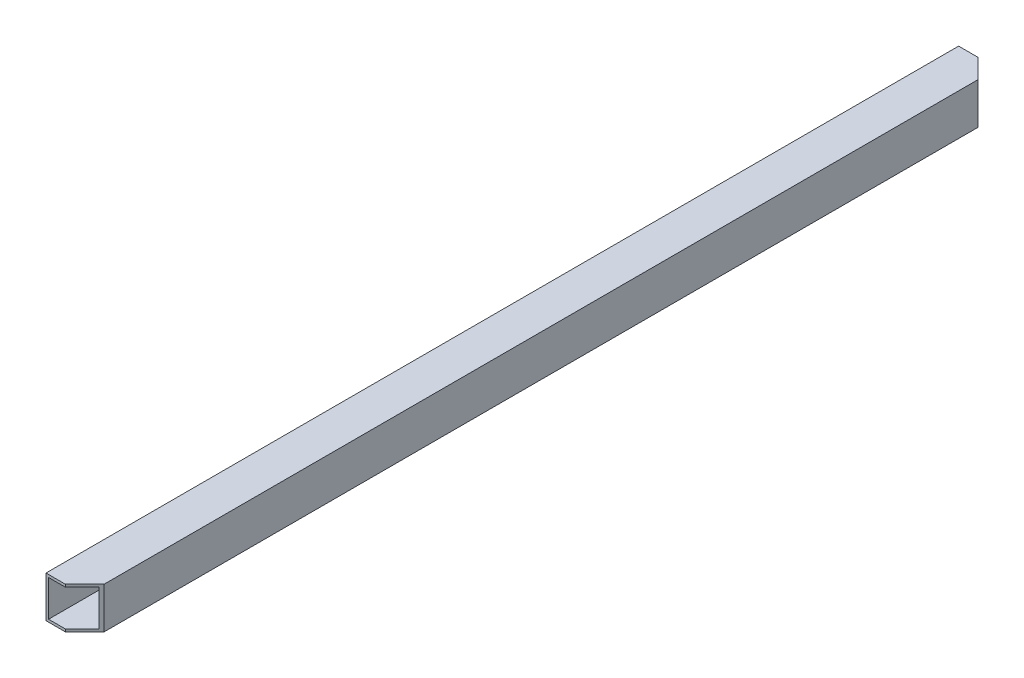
ISO-10303-21;
HEADER;
FILE_DESCRIPTION(('STEP AP214'),'2;1');
FILE_NAME('part.step','',(''),(''),'','','');
FILE_SCHEMA(('AUTOMOTIVE_DESIGN { 1 0 10303 214 1 1 1 1 }'));
ENDSEC;
DATA;
#1=APPLICATION_CONTEXT('core data for automotive mechanical design processes');
#2=APPLICATION_PROTOCOL_DEFINITION('international standard','automotive_design',2000,#1);
#3=PRODUCT_CONTEXT('',#1,'mechanical');
#4=PRODUCT('Part','Part','',(#3));
#5=PRODUCT_RELATED_PRODUCT_CATEGORY('part','',(#4));
#6=PRODUCT_DEFINITION_FORMATION('','',#4);
#7=PRODUCT_DEFINITION_CONTEXT('part definition',#1,'design');
#8=PRODUCT_DEFINITION('design','',#6,#7);
#9=PRODUCT_DEFINITION_SHAPE('','',#8);
#10=(LENGTH_UNIT() NAMED_UNIT(*) SI_UNIT(.MILLI.,.METRE.));
#11=(NAMED_UNIT(*) PLANE_ANGLE_UNIT() SI_UNIT($,.RADIAN.));
#12=(NAMED_UNIT(*) SI_UNIT($,.STERADIAN.) SOLID_ANGLE_UNIT());
#13=UNCERTAINTY_MEASURE_WITH_UNIT(LENGTH_MEASURE(1.E-05),#10,'distance_accuracy_value','');
#14=(GEOMETRIC_REPRESENTATION_CONTEXT(3) GLOBAL_UNCERTAINTY_ASSIGNED_CONTEXT((#13)) GLOBAL_UNIT_ASSIGNED_CONTEXT((#10,
#11,#12)) REPRESENTATION_CONTEXT('',''));
#15=CARTESIAN_POINT('',(0.,0.,0.));
#16=DIRECTION('',(0.,0.,1.));
#17=DIRECTION('',(1.,0.,0.));
#18=AXIS2_PLACEMENT_3D('',#15,#16,#17);
#19=CARTESIAN_POINT('',(32.5,-35.,0.));
#20=DIRECTION('',(-1.,0.,0.));
#21=DIRECTION('',(0.,0.,1.));
#22=AXIS2_PLACEMENT_3D('',#19,#20,#21);
#23=PLANE('',#22);
#24=DIRECTION('',(0.,1.,0.));
#25=VECTOR('',#24,1.);
#26=CARTESIAN_POINT('',(32.5,-17.5,32.5));
#27=LINE('',#26,#25);
#28=CARTESIAN_POINT('',(32.5,-35.,32.5));
#29=VERTEX_POINT('',#28);
#30=CARTESIAN_POINT('',(32.5,35.,32.5));
#31=VERTEX_POINT('',#30);
#32=EDGE_CURVE('E144',#29,#31,#27,.T.);
#33=ORIENTED_EDGE('',*,*,#32,.F.);
#34=DIRECTION('',(0.,0.,1.));
#35=VECTOR('',#34,1.);
#36=CARTESIAN_POINT('',(32.5,-35.,0.));
#37=LINE('',#36,#35);
#38=CARTESIAN_POINT('',(32.5,-35.,1734.5));
#39=VERTEX_POINT('',#38);
#40=EDGE_CURVE('E10',#29,#39,#37,.T.);
#41=ORIENTED_EDGE('',*,*,#40,.T.);
#42=DIRECTION('',(0.,-1.,0.));
#43=VECTOR('',#42,1.);
#44=CARTESIAN_POINT('',(32.5,-17.5,1734.5));
#45=LINE('',#44,#43);
#46=CARTESIAN_POINT('',(32.5,35.,1734.5));
#47=VERTEX_POINT('',#46);
#48=EDGE_CURVE('E224',#47,#39,#45,.T.);
#49=ORIENTED_EDGE('',*,*,#48,.F.);
#50=DIRECTION('',(0.,0.,1.));
#51=VECTOR('',#50,1.);
#52=CARTESIAN_POINT('',(32.5,35.,0.));
#53=LINE('',#52,#51);
#54=EDGE_CURVE('E249',#31,#47,#53,.T.);
#55=ORIENTED_EDGE('',*,*,#54,.F.);
#56=EDGE_LOOP('',(#33,#41,#49,#55));
#57=FACE_BOUND('',#56,.T.);
#58=ADVANCED_FACE('F16',(#57),#23,.T.);
#59=CARTESIAN_POINT('',(-32.5,-35.,0.));
#60=DIRECTION('',(0.,1.,0.));
#61=DIRECTION('',(1.,0.,0.));
#62=AXIS2_PLACEMENT_3D('',#59,#60,#61);
#63=PLANE('',#62);
#64=DIRECTION('',(1.,0.,0.));
#65=VECTOR('',#64,1.);
#66=CARTESIAN_POINT('',(-32.5,-35.,0.));
#67=LINE('',#66,#65);
#68=CARTESIAN_POINT('',(-32.5,-35.,0.));
#69=VERTEX_POINT('',#68);
#70=CARTESIAN_POINT('',(0.,-35.,0.));
#71=VERTEX_POINT('',#70);
#72=EDGE_CURVE('E184',#69,#71,#67,.T.);
#73=ORIENTED_EDGE('',*,*,#72,.F.);
#74=DIRECTION('',(0.,0.,1.));
#75=VECTOR('',#74,1.);
#76=CARTESIAN_POINT('',(-32.5,-35.,0.));
#77=LINE('',#76,#75);
#78=CARTESIAN_POINT('',(-32.5,-35.,1767.));
#79=VERTEX_POINT('',#78);
#80=EDGE_CURVE('E19',#69,#79,#77,.T.);
#81=ORIENTED_EDGE('',*,*,#80,.T.);
#82=DIRECTION('',(1.,0.,0.));
#83=VECTOR('',#82,1.);
#84=CARTESIAN_POINT('',(-32.5,-35.,1767.));
#85=LINE('',#84,#83);
#86=CARTESIAN_POINT('',(-4.547473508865E-13,-35.,1767.));
#87=VERTEX_POINT('',#86);
#88=EDGE_CURVE('E233',#79,#87,#85,.T.);
#89=ORIENTED_EDGE('',*,*,#88,.T.);
#90=DIRECTION('',(-0.707106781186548,0.,0.707106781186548));
#91=VECTOR('',#90,1.);
#92=CARTESIAN_POINT('',(875.375,-35.,891.625));
#93=LINE('',#92,#91);
#94=EDGE_CURVE('E202',#39,#87,#93,.T.);
#95=ORIENTED_EDGE('',*,*,#94,.F.);
#96=ORIENTED_EDGE('',*,*,#40,.F.);
#97=DIRECTION('',(0.707106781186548,0.,0.707106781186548));
#98=VECTOR('',#97,1.);
#99=CARTESIAN_POINT('',(-8.125,-35.,-8.125));
#100=LINE('',#99,#98);
#101=EDGE_CURVE('E187',#71,#29,#100,.T.);
#102=ORIENTED_EDGE('',*,*,#101,.F.);
#103=EDGE_LOOP('',(#73,#81,#89,#95,#96,#102));
#104=FACE_BOUND('',#103,.T.);
#105=ADVANCED_FACE('F258',(#104),#63,.T.);
#106=CARTESIAN_POINT('',(-32.5,35.,0.));
#107=DIRECTION('',(1.,0.,0.));
#108=DIRECTION('',(0.,1.,0.));
#109=AXIS2_PLACEMENT_3D('',#106,#107,#108);
#110=PLANE('',#109);
#111=DIRECTION('',(0.,0.,1.));
#112=VECTOR('',#111,1.);
#113=CARTESIAN_POINT('',(-32.5,35.,0.));
#114=LINE('',#113,#112);
#115=CARTESIAN_POINT('',(-32.5,35.,0.));
#116=VERTEX_POINT('',#115);
#117=CARTESIAN_POINT('',(-32.5,35.,1767.));
#118=VERTEX_POINT('',#117);
#119=EDGE_CURVE('E37',#116,#118,#114,.T.);
#120=ORIENTED_EDGE('',*,*,#119,.T.);
#121=DIRECTION('',(0.,-1.,0.));
#122=VECTOR('',#121,1.);
#123=CARTESIAN_POINT('',(-32.5,35.,1767.));
#124=LINE('',#123,#122);
#125=EDGE_CURVE('E236',#118,#79,#124,.T.);
#126=ORIENTED_EDGE('',*,*,#125,.T.);
#127=ORIENTED_EDGE('',*,*,#80,.F.);
#128=DIRECTION('',(0.,-1.,0.));
#129=VECTOR('',#128,1.);
#130=CARTESIAN_POINT('',(-32.5,35.,0.));
#131=LINE('',#130,#129);
#132=EDGE_CURVE('E155',#116,#69,#131,.T.);
#133=ORIENTED_EDGE('',*,*,#132,.F.);
#134=EDGE_LOOP('',(#120,#126,#127,#133));
#135=FACE_BOUND('',#134,.T.);
#136=ADVANCED_FACE('F263',(#135),#110,.T.);
#137=CARTESIAN_POINT('',(32.5,35.,0.));
#138=DIRECTION('',(0.,-1.,0.));
#139=DIRECTION('',(0.,0.,-1.));
#140=AXIS2_PLACEMENT_3D('',#137,#138,#139);
#141=PLANE('',#140);
#142=DIRECTION('',(-0.707106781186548,0.,-0.707106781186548));
#143=VECTOR('',#142,1.);
#144=CARTESIAN_POINT('',(8.125,35.,8.125));
#145=LINE('',#144,#143);
#146=CARTESIAN_POINT('',(0.,35.,0.));
#147=VERTEX_POINT('',#146);
#148=EDGE_CURVE('E135',#31,#147,#145,.T.);
#149=ORIENTED_EDGE('',*,*,#148,.F.);
#150=ORIENTED_EDGE('',*,*,#54,.T.);
#151=DIRECTION('',(0.707106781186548,0.,-0.707106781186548));
#152=VECTOR('',#151,1.);
#153=CARTESIAN_POINT('',(891.625,35.,875.375));
#154=LINE('',#153,#152);
#155=CARTESIAN_POINT('',(-4.547473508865E-13,35.,1767.));
#156=VERTEX_POINT('',#155);
#157=EDGE_CURVE('E220',#156,#47,#154,.T.);
#158=ORIENTED_EDGE('',*,*,#157,.F.);
#159=DIRECTION('',(-1.,0.,0.));
#160=VECTOR('',#159,1.);
#161=CARTESIAN_POINT('',(32.5,35.,1767.));
#162=LINE('',#161,#160);
#163=EDGE_CURVE('E239',#156,#118,#162,.T.);
#164=ORIENTED_EDGE('',*,*,#163,.T.);
#165=ORIENTED_EDGE('',*,*,#119,.F.);
#166=DIRECTION('',(-1.,0.,0.));
#167=VECTOR('',#166,1.);
#168=CARTESIAN_POINT('',(32.5,35.,0.));
#169=LINE('',#168,#167);
#170=EDGE_CURVE('E150',#147,#116,#169,.T.);
#171=ORIENTED_EDGE('',*,*,#170,.F.);
#172=EDGE_LOOP('',(#149,#150,#158,#164,#165,#171));
#173=FACE_BOUND('',#172,.T.);
#174=ADVANCED_FACE('F151',(#173),#141,.T.);
#175=CARTESIAN_POINT('',(37.5,40.,0.));
#176=DIRECTION('',(0.,-1.,0.));
#177=DIRECTION('',(0.,0.,-1.));
#178=AXIS2_PLACEMENT_3D('',#175,#176,#177);
#179=PLANE('',#178);
#180=DIRECTION('',(-1.,0.,0.));
#181=VECTOR('',#180,1.);
#182=CARTESIAN_POINT('',(37.5,40.,0.));
#183=LINE('',#182,#181);
#184=CARTESIAN_POINT('',(0.,40.,0.));
#185=VERTEX_POINT('',#184);
#186=CARTESIAN_POINT('',(-37.5,40.,0.));
#187=VERTEX_POINT('',#186);
#188=EDGE_CURVE('E160',#185,#187,#183,.T.);
#189=ORIENTED_EDGE('',*,*,#188,.T.);
#190=DIRECTION('',(0.,0.,1.));
#191=VECTOR('',#190,1.);
#192=CARTESIAN_POINT('',(-37.5,40.,0.));
#193=LINE('',#192,#191);
#194=CARTESIAN_POINT('',(-37.5,40.,1767.));
#195=VERTEX_POINT('',#194);
#196=EDGE_CURVE('E246',#187,#195,#193,.T.);
#197=ORIENTED_EDGE('',*,*,#196,.T.);
#198=DIRECTION('',(-1.,0.,0.));
#199=VECTOR('',#198,1.);
#200=CARTESIAN_POINT('',(37.5,40.,1767.));
#201=LINE('',#200,#199);
#202=CARTESIAN_POINT('',(-4.547473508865E-13,40.,1767.));
#203=VERTEX_POINT('',#202);
#204=EDGE_CURVE('E242',#203,#195,#201,.T.);
#205=ORIENTED_EDGE('',*,*,#204,.F.);
#206=DIRECTION('',(0.707106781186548,0.,-0.707106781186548));
#207=VECTOR('',#206,1.);
#208=CARTESIAN_POINT('',(892.875,40.,874.125));
#209=LINE('',#208,#207);
#210=CARTESIAN_POINT('',(37.5,40.,1729.5));
#211=VERTEX_POINT('',#210);
#212=EDGE_CURVE('E213',#203,#211,#209,.T.);
#213=ORIENTED_EDGE('',*,*,#212,.T.);
#214=DIRECTION('',(0.,0.,1.));
#215=VECTOR('',#214,1.);
#216=CARTESIAN_POINT('',(37.5,40.,0.));
#217=LINE('',#216,#215);
#218=CARTESIAN_POINT('',(37.5,40.,37.5));
#219=VERTEX_POINT('',#218);
#220=EDGE_CURVE('E206',#219,#211,#217,.T.);
#221=ORIENTED_EDGE('',*,*,#220,.F.);
#222=DIRECTION('',(-0.707106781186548,0.,-0.707106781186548));
#223=VECTOR('',#222,1.);
#224=CARTESIAN_POINT('',(9.375,40.,9.375));
#225=LINE('',#224,#223);
#226=EDGE_CURVE('E147',#219,#185,#225,.T.);
#227=ORIENTED_EDGE('',*,*,#226,.T.);
#228=EDGE_LOOP('',(#189,#197,#205,#213,#221,#227));
#229=FACE_BOUND('',#228,.T.);
#230=ADVANCED_FACE('F319',(#229),#179,.F.);
#231=CARTESIAN_POINT('',(-37.5,40.,0.));
#232=DIRECTION('',(1.,0.,0.));
#233=DIRECTION('',(0.,1.,0.));
#234=AXIS2_PLACEMENT_3D('',#231,#232,#233);
#235=PLANE('',#234);
#236=DIRECTION('',(0.,-1.,0.));
#237=VECTOR('',#236,1.);
#238=CARTESIAN_POINT('',(-37.5,40.,0.));
#239=LINE('',#238,#237);
#240=CARTESIAN_POINT('',(-37.5,-40.,0.));
#241=VERTEX_POINT('',#240);
#242=EDGE_CURVE('E194',#187,#241,#239,.T.);
#243=ORIENTED_EDGE('',*,*,#242,.T.);
#244=DIRECTION('',(0.,0.,1.));
#245=VECTOR('',#244,1.);
#246=CARTESIAN_POINT('',(-37.5,-40.,0.));
#247=LINE('',#246,#245);
#248=CARTESIAN_POINT('',(-37.5,-40.,1767.));
#249=VERTEX_POINT('',#248);
#250=EDGE_CURVE('E175',#241,#249,#247,.T.);
#251=ORIENTED_EDGE('',*,*,#250,.T.);
#252=DIRECTION('',(0.,-1.,0.));
#253=VECTOR('',#252,1.);
#254=CARTESIAN_POINT('',(-37.5,40.,1767.));
#255=LINE('',#254,#253);
#256=EDGE_CURVE('E201',#195,#249,#255,.T.);
#257=ORIENTED_EDGE('',*,*,#256,.F.);
#258=ORIENTED_EDGE('',*,*,#196,.F.);
#259=EDGE_LOOP('',(#243,#251,#257,#258));
#260=FACE_BOUND('',#259,.T.);
#261=ADVANCED_FACE('F301',(#260),#235,.F.);
#262=CARTESIAN_POINT('',(0.,0.,1767.));
#263=DIRECTION('',(0.,0.,1.));
#264=DIRECTION('',(1.,0.,0.));
#265=AXIS2_PLACEMENT_3D('',#262,#263,#264);
#266=PLANE('',#265);
#267=ORIENTED_EDGE('',*,*,#256,.T.);
#268=DIRECTION('',(1.,0.,0.));
#269=VECTOR('',#268,1.);
#270=CARTESIAN_POINT('',(-37.5,-40.,1767.));
#271=LINE('',#270,#269);
#272=CARTESIAN_POINT('',(-4.547473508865E-13,-40.,1767.));
#273=VERTEX_POINT('',#272);
#274=EDGE_CURVE('E172',#249,#273,#271,.T.);
#275=ORIENTED_EDGE('',*,*,#274,.T.);
#276=DIRECTION('',(0.,-1.,0.));
#277=VECTOR('',#276,1.);
#278=CARTESIAN_POINT('',(-3.215549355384E-13,0.,1767.));
#279=LINE('',#278,#277);
#280=EDGE_CURVE('E198',#87,#273,#279,.T.);
#281=ORIENTED_EDGE('',*,*,#280,.F.);
#282=ORIENTED_EDGE('',*,*,#88,.F.);
#283=ORIENTED_EDGE('',*,*,#125,.F.);
#284=ORIENTED_EDGE('',*,*,#163,.F.);
#285=DIRECTION('',(0.,-1.,0.));
#286=VECTOR('',#285,1.);
#287=CARTESIAN_POINT('',(-3.215549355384E-13,0.,1767.));
#288=LINE('',#287,#286);
#289=EDGE_CURVE('E216',#203,#156,#288,.T.);
#290=ORIENTED_EDGE('',*,*,#289,.F.);
#291=ORIENTED_EDGE('',*,*,#204,.T.);
#292=EDGE_LOOP('',(#267,#275,#281,#282,#283,#284,#290,#291));
#293=FACE_BOUND('',#292,.T.);
#294=ADVANCED_FACE('F295',(#293),#266,.T.);
#295=CARTESIAN_POINT('',(883.5,0.,883.5));
#296=DIRECTION('',(-0.707106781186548,0.,-0.707106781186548));
#297=DIRECTION('',(-0.707106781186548,0.,0.707106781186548));
#298=AXIS2_PLACEMENT_3D('',#295,#296,#297);
#299=PLANE('',#298);
#300=ORIENTED_EDGE('',*,*,#212,.F.);
#301=ORIENTED_EDGE('',*,*,#289,.T.);
#302=ORIENTED_EDGE('',*,*,#157,.T.);
#303=ORIENTED_EDGE('',*,*,#48,.T.);
#304=ORIENTED_EDGE('',*,*,#94,.T.);
#305=ORIENTED_EDGE('',*,*,#280,.T.);
#306=DIRECTION('',(-0.707106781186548,0.,0.707106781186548));
#307=VECTOR('',#306,1.);
#308=CARTESIAN_POINT('',(874.125,-40.,892.875));
#309=LINE('',#308,#307);
#310=CARTESIAN_POINT('',(37.5,-40.,1729.5));
#311=VERTEX_POINT('',#310);
#312=EDGE_CURVE('E171',#311,#273,#309,.T.);
#313=ORIENTED_EDGE('',*,*,#312,.F.);
#314=DIRECTION('',(0.,-1.,0.));
#315=VECTOR('',#314,1.);
#316=CARTESIAN_POINT('',(37.5,-20.,1729.5));
#317=LINE('',#316,#315);
#318=EDGE_CURVE('E209',#211,#311,#317,.T.);
#319=ORIENTED_EDGE('',*,*,#318,.F.);
#320=EDGE_LOOP('',(#300,#301,#302,#303,#304,#305,#313,#319));
#321=FACE_BOUND('',#320,.T.);
#322=ADVANCED_FACE('F300',(#321),#299,.F.);
#323=CARTESIAN_POINT('',(37.5,-40.,0.));
#324=DIRECTION('',(-1.,0.,0.));
#325=DIRECTION('',(0.,0.,1.));
#326=AXIS2_PLACEMENT_3D('',#323,#324,#325);
#327=PLANE('',#326);
#328=ORIENTED_EDGE('',*,*,#220,.T.);
#329=ORIENTED_EDGE('',*,*,#318,.T.);
#330=DIRECTION('',(0.,0.,1.));
#331=VECTOR('',#330,1.);
#332=CARTESIAN_POINT('',(37.5,-40.,0.));
#333=LINE('',#332,#331);
#334=CARTESIAN_POINT('',(37.5,-40.,37.5));
#335=VERTEX_POINT('',#334);
#336=EDGE_CURVE('E385',#335,#311,#333,.T.);
#337=ORIENTED_EDGE('',*,*,#336,.F.);
#338=DIRECTION('',(0.,1.,0.));
#339=VECTOR('',#338,1.);
#340=CARTESIAN_POINT('',(37.5,-20.,37.5));
#341=LINE('',#340,#339);
#342=EDGE_CURVE('E197',#335,#219,#341,.T.);
#343=ORIENTED_EDGE('',*,*,#342,.T.);
#344=EDGE_LOOP('',(#328,#329,#337,#343));
#345=FACE_BOUND('',#344,.T.);
#346=ADVANCED_FACE('F290',(#345),#327,.F.);
#347=CARTESIAN_POINT('',(0.,0.,0.));
#348=DIRECTION('',(-0.707106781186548,0.,0.707106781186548));
#349=DIRECTION('',(0.,1.,0.));
#350=AXIS2_PLACEMENT_3D('',#347,#348,#349);
#351=PLANE('',#350);
#352=ORIENTED_EDGE('',*,*,#101,.T.);
#353=ORIENTED_EDGE('',*,*,#32,.T.);
#354=ORIENTED_EDGE('',*,*,#148,.T.);
#355=DIRECTION('',(0.,-1.,0.));
#356=VECTOR('',#355,1.);
#357=CARTESIAN_POINT('',(0.,0.,0.));
#358=LINE('',#357,#356);
#359=EDGE_CURVE('E141',#185,#147,#358,.T.);
#360=ORIENTED_EDGE('',*,*,#359,.F.);
#361=ORIENTED_EDGE('',*,*,#226,.F.);
#362=ORIENTED_EDGE('',*,*,#342,.F.);
#363=DIRECTION('',(0.707106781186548,0.,0.707106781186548));
#364=VECTOR('',#363,1.);
#365=CARTESIAN_POINT('',(-9.375,-40.,-9.375));
#366=LINE('',#365,#364);
#367=CARTESIAN_POINT('',(0.,-40.,0.));
#368=VERTEX_POINT('',#367);
#369=EDGE_CURVE('E381',#368,#335,#366,.T.);
#370=ORIENTED_EDGE('',*,*,#369,.F.);
#371=DIRECTION('',(0.,-1.,0.));
#372=VECTOR('',#371,1.);
#373=CARTESIAN_POINT('',(0.,0.,0.));
#374=LINE('',#373,#372);
#375=EDGE_CURVE('E191',#71,#368,#374,.T.);
#376=ORIENTED_EDGE('',*,*,#375,.F.);
#377=EDGE_LOOP('',(#352,#353,#354,#360,#361,#362,#370,#376));
#378=FACE_BOUND('',#377,.T.);
#379=ADVANCED_FACE('F138',(#378),#351,.F.);
#380=CARTESIAN_POINT('',(0.,0.,0.));
#381=DIRECTION('',(0.,0.,1.));
#382=DIRECTION('',(1.,0.,0.));
#383=AXIS2_PLACEMENT_3D('',#380,#381,#382);
#384=PLANE('',#383);
#385=ORIENTED_EDGE('',*,*,#188,.F.);
#386=ORIENTED_EDGE('',*,*,#359,.T.);
#387=ORIENTED_EDGE('',*,*,#170,.T.);
#388=ORIENTED_EDGE('',*,*,#132,.T.);
#389=ORIENTED_EDGE('',*,*,#72,.T.);
#390=ORIENTED_EDGE('',*,*,#375,.T.);
#391=DIRECTION('',(1.,0.,0.));
#392=VECTOR('',#391,1.);
#393=CARTESIAN_POINT('',(-37.5,-40.,0.));
#394=LINE('',#393,#392);
#395=EDGE_CURVE('E167',#241,#368,#394,.T.);
#396=ORIENTED_EDGE('',*,*,#395,.F.);
#397=ORIENTED_EDGE('',*,*,#242,.F.);
#398=EDGE_LOOP('',(#385,#386,#387,#388,#389,#390,#396,#397));
#399=FACE_BOUND('',#398,.T.);
#400=ADVANCED_FACE('F157',(#399),#384,.F.);
#401=CARTESIAN_POINT('',(-37.5,-40.,0.));
#402=DIRECTION('',(0.,1.,0.));
#403=DIRECTION('',(1.,0.,0.));
#404=AXIS2_PLACEMENT_3D('',#401,#402,#403);
#405=PLANE('',#404);
#406=ORIENTED_EDGE('',*,*,#369,.T.);
#407=ORIENTED_EDGE('',*,*,#336,.T.);
#408=ORIENTED_EDGE('',*,*,#312,.T.);
#409=ORIENTED_EDGE('',*,*,#274,.F.);
#410=ORIENTED_EDGE('',*,*,#250,.F.);
#411=ORIENTED_EDGE('',*,*,#395,.T.);
#412=EDGE_LOOP('',(#406,#407,#408,#409,#410,#411));
#413=FACE_BOUND('',#412,.T.);
#414=ADVANCED_FACE('F270',(#413),#405,.F.);
#415=CLOSED_SHELL('',(#58,#105,#136,#174,#230,#261,#294,#322,#346,#379,#400,#414));
#416=MANIFOLD_SOLID_BREP('B1',#415);
#417=ADVANCED_BREP_SHAPE_REPRESENTATION('',(#18,#416),#14);
#418=SHAPE_DEFINITION_REPRESENTATION(#9,#417);
ENDSEC;
END-ISO-10303-21;
